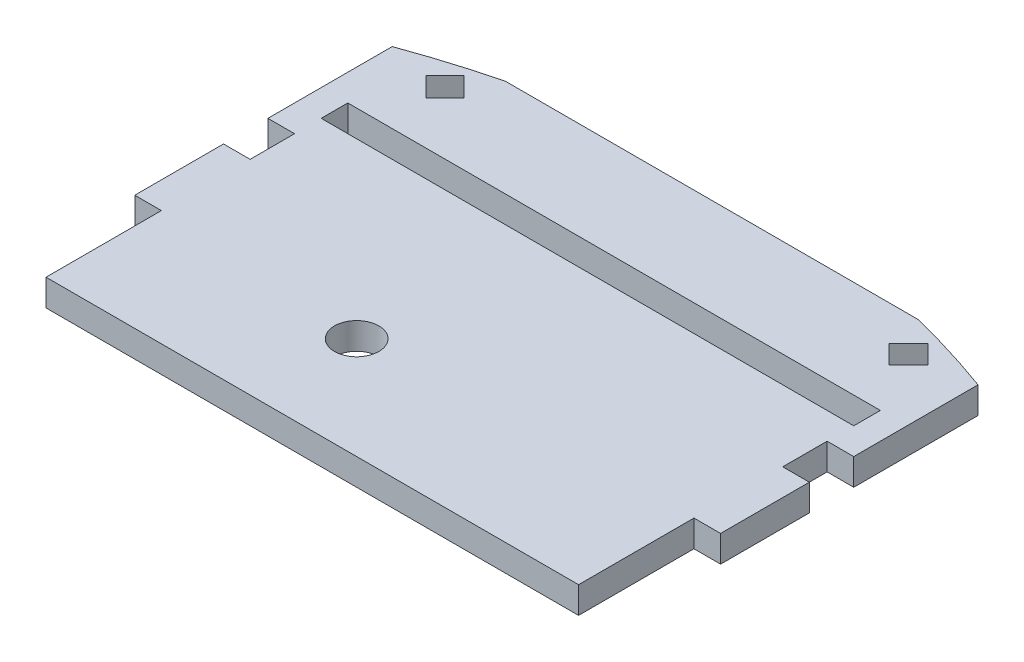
ISO-10303-21;
HEADER;
FILE_DESCRIPTION(('STEP AP214'),'2;1');
FILE_NAME('part.step','',(''),(''),'','','');
FILE_SCHEMA(('AUTOMOTIVE_DESIGN { 1 0 10303 214 1 1 1 1 }'));
ENDSEC;
DATA;
#1=APPLICATION_CONTEXT('core data for automotive mechanical design processes');
#2=APPLICATION_PROTOCOL_DEFINITION('international standard','automotive_design',2000,#1);
#3=PRODUCT_CONTEXT('',#1,'mechanical');
#4=PRODUCT('Part','Part','',(#3));
#5=PRODUCT_RELATED_PRODUCT_CATEGORY('part','',(#4));
#6=PRODUCT_DEFINITION_FORMATION('','',#4);
#7=PRODUCT_DEFINITION_CONTEXT('part definition',#1,'design');
#8=PRODUCT_DEFINITION('design','',#6,#7);
#9=PRODUCT_DEFINITION_SHAPE('','',#8);
#10=(LENGTH_UNIT() NAMED_UNIT(*) SI_UNIT(.MILLI.,.METRE.));
#11=(NAMED_UNIT(*) PLANE_ANGLE_UNIT() SI_UNIT($,.RADIAN.));
#12=(NAMED_UNIT(*) SI_UNIT($,.STERADIAN.) SOLID_ANGLE_UNIT());
#13=UNCERTAINTY_MEASURE_WITH_UNIT(LENGTH_MEASURE(1.E-05),#10,'distance_accuracy_value','');
#14=(GEOMETRIC_REPRESENTATION_CONTEXT(3) GLOBAL_UNCERTAINTY_ASSIGNED_CONTEXT((#13)) GLOBAL_UNIT_ASSIGNED_CONTEXT((#10,
#11,#12)) REPRESENTATION_CONTEXT('',''));
#15=CARTESIAN_POINT('',(0.,0.,0.));
#16=DIRECTION('',(0.,0.,1.));
#17=DIRECTION('',(1.,0.,0.));
#18=AXIS2_PLACEMENT_3D('',#15,#16,#17);
#19=CARTESIAN_POINT('',(30.,3.,18.));
#20=DIRECTION('',(0.,1.,0.));
#21=DIRECTION('',(0.,0.,1.));
#22=AXIS2_PLACEMENT_3D('',#19,#20,#21);
#23=PLANE('',#22);
#24=DIRECTION('',(0.707106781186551,0.,-0.707106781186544));
#25=VECTOR('',#24,1.);
#26=CARTESIAN_POINT('',(-26.0811183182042,3.,-20.9188816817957));
#27=LINE('',#26,#25);
#28=CARTESIAN_POINT('',(-26.0811183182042,3.,-20.9188816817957));
#29=VERTEX_POINT('',#28);
#30=CARTESIAN_POINT('',(-23.9597979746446,3.,-23.0402020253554));
#31=VERTEX_POINT('',#30);
#32=EDGE_CURVE('E479',#29,#31,#27,.T.);
#33=ORIENTED_EDGE('',*,*,#32,.F.);
#34=DIRECTION('',(0.707106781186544,0.,0.707106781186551));
#35=VECTOR('',#34,1.);
#36=CARTESIAN_POINT('',(-26.0811183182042,3.,-20.9188816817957));
#37=LINE('',#36,#35);
#38=CARTESIAN_POINT('',(-28.2731493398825,3.,-23.110912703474));
#39=VERTEX_POINT('',#38);
#40=EDGE_CURVE('E464',#39,#29,#37,.T.);
#41=ORIENTED_EDGE('',*,*,#40,.F.);
#42=DIRECTION('',(-0.707106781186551,0.,0.707106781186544));
#43=VECTOR('',#42,1.);
#44=CARTESIAN_POINT('',(-28.2731493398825,3.,-23.110912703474));
#45=LINE('',#44,#43);
#46=CARTESIAN_POINT('',(-26.1518289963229,3.,-25.2322330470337));
#47=VERTEX_POINT('',#46);
#48=EDGE_CURVE('E460',#47,#39,#45,.T.);
#49=ORIENTED_EDGE('',*,*,#48,.F.);
#50=DIRECTION('',(-0.707106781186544,0.,-0.707106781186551));
#51=VECTOR('',#50,1.);
#52=CARTESIAN_POINT('',(-23.9597979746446,3.,-23.0402020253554));
#53=LINE('',#52,#51);
#54=EDGE_CURVE('E476',#31,#47,#53,.T.);
#55=ORIENTED_EDGE('',*,*,#54,.F.);
#56=EDGE_LOOP('',(#33,#41,#49,#55));
#57=FACE_BOUND('',#56,.T.);
#58=CARTESIAN_POINT('',(-6.5,3.,6.5));
#59=DIRECTION('',(0.,1.,0.));
#60=DIRECTION('',(0.,0.,1.));
#61=AXIS2_PLACEMENT_3D('',#58,#59,#60);
#62=CIRCLE('',#61,2.5);
#63=CARTESIAN_POINT('',(-6.5,3.,9.));
#64=VERTEX_POINT('',#63);
#65=EDGE_CURVE('E367',#64,#64,#62,.T.);
#66=ORIENTED_EDGE('',*,*,#65,.F.);
#67=EDGE_LOOP('',(#66));
#68=FACE_BOUND('',#67,.T.);
#69=DIRECTION('',(-1.,0.,0.));
#70=VECTOR('',#69,1.);
#71=CARTESIAN_POINT('',(-30.,3.,-16.));
#72=LINE('',#71,#70);
#73=CARTESIAN_POINT('',(30.,3.,-16.));
#74=VERTEX_POINT('',#73);
#75=CARTESIAN_POINT('',(-30.,3.,-16.));
#76=VERTEX_POINT('',#75);
#77=EDGE_CURVE('E448',#74,#76,#72,.T.);
#78=ORIENTED_EDGE('',*,*,#77,.F.);
#79=DIRECTION('',(0.,0.,-1.));
#80=VECTOR('',#79,1.);
#81=CARTESIAN_POINT('',(30.,3.,-16.));
#82=LINE('',#81,#80);
#83=CARTESIAN_POINT('',(30.,3.,-13.));
#84=VERTEX_POINT('',#83);
#85=EDGE_CURVE('E433',#84,#74,#82,.T.);
#86=ORIENTED_EDGE('',*,*,#85,.F.);
#87=DIRECTION('',(1.,0.,0.));
#88=VECTOR('',#87,1.);
#89=CARTESIAN_POINT('',(-30.,3.,-13.));
#90=LINE('',#89,#88);
#91=CARTESIAN_POINT('',(-30.,3.,-13.));
#92=VERTEX_POINT('',#91);
#93=EDGE_CURVE('E429',#92,#84,#90,.T.);
#94=ORIENTED_EDGE('',*,*,#93,.F.);
#95=DIRECTION('',(0.,0.,1.));
#96=VECTOR('',#95,1.);
#97=CARTESIAN_POINT('',(-30.,3.,-16.));
#98=LINE('',#97,#96);
#99=EDGE_CURVE('E445',#76,#92,#98,.T.);
#100=ORIENTED_EDGE('',*,*,#99,.F.);
#101=EDGE_LOOP('',(#78,#86,#94,#100));
#102=FACE_BOUND('',#101,.T.);
#103=DIRECTION('',(-0.707106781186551,0.,-0.707106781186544));
#104=VECTOR('',#103,1.);
#105=CARTESIAN_POINT('',(28.2731493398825,3.,-23.110912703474));
#106=LINE('',#105,#104);
#107=CARTESIAN_POINT('',(28.2731493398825,3.,-23.110912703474));
#108=VERTEX_POINT('',#107);
#109=CARTESIAN_POINT('',(26.1518289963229,3.,-25.2322330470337));
#110=VERTEX_POINT('',#109);
#111=EDGE_CURVE('E510',#108,#110,#106,.T.);
#112=ORIENTED_EDGE('',*,*,#111,.F.);
#113=DIRECTION('',(0.707106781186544,0.,-0.707106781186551));
#114=VECTOR('',#113,1.);
#115=CARTESIAN_POINT('',(26.0811183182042,3.,-20.9188816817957));
#116=LINE('',#115,#114);
#117=CARTESIAN_POINT('',(26.0811183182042,3.,-20.9188816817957));
#118=VERTEX_POINT('',#117);
#119=EDGE_CURVE('E495',#118,#108,#116,.T.);
#120=ORIENTED_EDGE('',*,*,#119,.F.);
#121=DIRECTION('',(0.707106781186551,0.,0.707106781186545));
#122=VECTOR('',#121,1.);
#123=CARTESIAN_POINT('',(26.0811183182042,3.,-20.9188816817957));
#124=LINE('',#123,#122);
#125=CARTESIAN_POINT('',(23.9597979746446,3.,-23.0402020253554));
#126=VERTEX_POINT('',#125);
#127=EDGE_CURVE('E491',#126,#118,#124,.T.);
#128=ORIENTED_EDGE('',*,*,#127,.F.);
#129=DIRECTION('',(-0.707106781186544,0.,0.707106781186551));
#130=VECTOR('',#129,1.);
#131=CARTESIAN_POINT('',(23.9597979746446,3.,-23.0402020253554));
#132=LINE('',#131,#130);
#133=EDGE_CURVE('E507',#110,#126,#132,.T.);
#134=ORIENTED_EDGE('',*,*,#133,.F.);
#135=EDGE_LOOP('',(#112,#120,#128,#134));
#136=FACE_BOUND('',#135,.T.);
#137=DIRECTION('',(0.,0.,-1.));
#138=VECTOR('',#137,1.);
#139=CARTESIAN_POINT('',(33.,3.,-27.));
#140=LINE('',#139,#138);
#141=CARTESIAN_POINT('',(33.,3.,-10.));
#142=VERTEX_POINT('',#141);
#143=CARTESIAN_POINT('',(33.,3.,-24.));
#144=VERTEX_POINT('',#143);
#145=EDGE_CURVE('E261',#142,#144,#140,.T.);
#146=ORIENTED_EDGE('',*,*,#145,.T.);
#147=CARTESIAN_POINT('',(0.,3.,66.));
#148=DIRECTION('',(0.,1.,0.));
#149=DIRECTION('',(0.,0.,1.));
#150=AXIS2_PLACEMENT_3D('',#147,#148,#149);
#151=CIRCLE('',#150,95.8592718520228);
#152=CARTESIAN_POINT('',(23.2379000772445,3.,-27.));
#153=VERTEX_POINT('',#152);
#154=EDGE_CURVE('E251',#153,#144,#151,.F.);
#155=ORIENTED_EDGE('',*,*,#154,.F.);
#156=DIRECTION('',(-1.,0.,0.));
#157=VECTOR('',#156,1.);
#158=CARTESIAN_POINT('',(-33.,3.,-27.));
#159=LINE('',#158,#157);
#160=CARTESIAN_POINT('',(-23.2379000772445,3.,-27.));
#161=VERTEX_POINT('',#160);
#162=EDGE_CURVE('E250',#153,#161,#159,.T.);
#163=ORIENTED_EDGE('',*,*,#162,.T.);
#164=CARTESIAN_POINT('',(-33.,3.,-24.));
#165=VERTEX_POINT('',#164);
#166=EDGE_CURVE('E234',#165,#161,#151,.F.);
#167=ORIENTED_EDGE('',*,*,#166,.F.);
#168=DIRECTION('',(0.,0.,1.));
#169=VECTOR('',#168,1.);
#170=CARTESIAN_POINT('',(-33.,3.,-27.));
#171=LINE('',#170,#169);
#172=CARTESIAN_POINT('',(-33.,3.,-10.));
#173=VERTEX_POINT('',#172);
#174=EDGE_CURVE('E246',#165,#173,#171,.T.);
#175=ORIENTED_EDGE('',*,*,#174,.T.);
#176=DIRECTION('',(1.,0.,0.));
#177=VECTOR('',#176,1.);
#178=CARTESIAN_POINT('',(-33.,3.,-10.));
#179=LINE('',#178,#177);
#180=CARTESIAN_POINT('',(-30.,3.,-10.));
#181=VERTEX_POINT('',#180);
#182=EDGE_CURVE('E259',#173,#181,#179,.T.);
#183=ORIENTED_EDGE('',*,*,#182,.T.);
#184=DIRECTION('',(0.,0.,1.));
#185=VECTOR('',#184,1.);
#186=CARTESIAN_POINT('',(-30.,3.,-18.));
#187=LINE('',#186,#185);
#188=CARTESIAN_POINT('',(-30.,3.,-4.99999999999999));
#189=VERTEX_POINT('',#188);
#190=EDGE_CURVE('E39',#181,#189,#187,.T.);
#191=ORIENTED_EDGE('',*,*,#190,.T.);
#192=DIRECTION('',(-1.,0.,0.));
#193=VECTOR('',#192,1.);
#194=CARTESIAN_POINT('',(-33.,3.,-4.99999999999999));
#195=LINE('',#194,#193);
#196=CARTESIAN_POINT('',(-33.,3.,-4.99999999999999));
#197=VERTEX_POINT('',#196);
#198=EDGE_CURVE('E346',#189,#197,#195,.T.);
#199=ORIENTED_EDGE('',*,*,#198,.T.);
#200=DIRECTION('',(0.,0.,1.));
#201=VECTOR('',#200,1.);
#202=CARTESIAN_POINT('',(-33.,3.,-4.99999999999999));
#203=LINE('',#202,#201);
#204=CARTESIAN_POINT('',(-33.,3.,5.00000000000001));
#205=VERTEX_POINT('',#204);
#206=EDGE_CURVE('E358',#197,#205,#203,.T.);
#207=ORIENTED_EDGE('',*,*,#206,.T.);
#208=DIRECTION('',(1.,0.,0.));
#209=VECTOR('',#208,1.);
#210=CARTESIAN_POINT('',(-33.,3.,5.00000000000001));
#211=LINE('',#210,#209);
#212=CARTESIAN_POINT('',(-30.,3.,5.00000000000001));
#213=VERTEX_POINT('',#212);
#214=EDGE_CURVE('E880',#205,#213,#211,.T.);
#215=ORIENTED_EDGE('',*,*,#214,.T.);
#216=CARTESIAN_POINT('',(-30.,3.,18.));
#217=VERTEX_POINT('',#216);
#218=EDGE_CURVE('E327',#213,#217,#187,.T.);
#219=ORIENTED_EDGE('',*,*,#218,.T.);
#220=DIRECTION('',(1.,0.,0.));
#221=VECTOR('',#220,1.);
#222=CARTESIAN_POINT('',(-30.,3.,18.));
#223=LINE('',#222,#221);
#224=CARTESIAN_POINT('',(30.,3.,18.));
#225=VERTEX_POINT('',#224);
#226=EDGE_CURVE('E337',#217,#225,#223,.T.);
#227=ORIENTED_EDGE('',*,*,#226,.T.);
#228=DIRECTION('',(0.,0.,-1.));
#229=VECTOR('',#228,1.);
#230=CARTESIAN_POINT('',(30.,3.,-18.));
#231=LINE('',#230,#229);
#232=CARTESIAN_POINT('',(30.,3.,5.00000000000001));
#233=VERTEX_POINT('',#232);
#234=EDGE_CURVE('E329',#225,#233,#231,.T.);
#235=ORIENTED_EDGE('',*,*,#234,.T.);
#236=DIRECTION('',(1.,0.,0.));
#237=VECTOR('',#236,1.);
#238=CARTESIAN_POINT('',(33.,3.,5.00000000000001));
#239=LINE('',#238,#237);
#240=CARTESIAN_POINT('',(33.,3.,5.00000000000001));
#241=VERTEX_POINT('',#240);
#242=EDGE_CURVE('E296',#233,#241,#239,.T.);
#243=ORIENTED_EDGE('',*,*,#242,.T.);
#244=DIRECTION('',(0.,0.,-1.));
#245=VECTOR('',#244,1.);
#246=CARTESIAN_POINT('',(33.,3.,-4.99999999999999));
#247=LINE('',#246,#245);
#248=CARTESIAN_POINT('',(33.,3.,-4.99999999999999));
#249=VERTEX_POINT('',#248);
#250=EDGE_CURVE('E284',#241,#249,#247,.T.);
#251=ORIENTED_EDGE('',*,*,#250,.T.);
#252=DIRECTION('',(-1.,0.,0.));
#253=VECTOR('',#252,1.);
#254=CARTESIAN_POINT('',(33.,3.,-4.99999999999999));
#255=LINE('',#254,#253);
#256=CARTESIAN_POINT('',(30.,3.,-4.99999999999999));
#257=VERTEX_POINT('',#256);
#258=EDGE_CURVE('E287',#249,#257,#255,.T.);
#259=ORIENTED_EDGE('',*,*,#258,.T.);
#260=CARTESIAN_POINT('',(30.,3.,-10.));
#261=VERTEX_POINT('',#260);
#262=EDGE_CURVE('E393',#257,#261,#231,.T.);
#263=ORIENTED_EDGE('',*,*,#262,.T.);
#264=EDGE_CURVE('E257',#261,#142,#179,.T.);
#265=ORIENTED_EDGE('',*,*,#264,.T.);
#266=EDGE_LOOP('',(#146,#155,#163,#167,#175,#183,#191,#199,#207,#215,#219,#227,#235,#243,#251,
#259,#263,#265));
#267=FACE_BOUND('',#266,.T.);
#268=ADVANCED_FACE('F35',(#57,#68,#102,#136,#267),#23,.T.);
#269=CARTESIAN_POINT('',(30.,0.,18.));
#270=DIRECTION('',(0.,1.,0.));
#271=DIRECTION('',(0.,0.,1.));
#272=AXIS2_PLACEMENT_3D('',#269,#270,#271);
#273=PLANE('',#272);
#274=DIRECTION('',(0.707106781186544,0.,0.707106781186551));
#275=VECTOR('',#274,1.);
#276=CARTESIAN_POINT('',(-26.0811183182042,0.,-20.9188816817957));
#277=LINE('',#276,#275);
#278=CARTESIAN_POINT('',(-28.2731493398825,0.,-23.110912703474));
#279=VERTEX_POINT('',#278);
#280=CARTESIAN_POINT('',(-26.0811183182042,0.,-20.9188816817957));
#281=VERTEX_POINT('',#280);
#282=EDGE_CURVE('E471',#279,#281,#277,.T.);
#283=ORIENTED_EDGE('',*,*,#282,.T.);
#284=DIRECTION('',(0.707106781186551,0.,-0.707106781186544));
#285=VECTOR('',#284,1.);
#286=CARTESIAN_POINT('',(-26.0811183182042,0.,-20.9188816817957));
#287=LINE('',#286,#285);
#288=CARTESIAN_POINT('',(-23.9597979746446,0.,-23.0402020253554));
#289=VERTEX_POINT('',#288);
#290=EDGE_CURVE('E468',#281,#289,#287,.T.);
#291=ORIENTED_EDGE('',*,*,#290,.T.);
#292=DIRECTION('',(-0.707106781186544,0.,-0.707106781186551));
#293=VECTOR('',#292,1.);
#294=CARTESIAN_POINT('',(-23.9597979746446,0.,-23.0402020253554));
#295=LINE('',#294,#293);
#296=CARTESIAN_POINT('',(-26.1518289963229,0.,-25.2322330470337));
#297=VERTEX_POINT('',#296);
#298=EDGE_CURVE('E465',#289,#297,#295,.T.);
#299=ORIENTED_EDGE('',*,*,#298,.T.);
#300=DIRECTION('',(-0.707106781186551,0.,0.707106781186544));
#301=VECTOR('',#300,1.);
#302=CARTESIAN_POINT('',(-28.2731493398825,0.,-23.110912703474));
#303=LINE('',#302,#301);
#304=EDGE_CURVE('E461',#297,#279,#303,.T.);
#305=ORIENTED_EDGE('',*,*,#304,.T.);
#306=EDGE_LOOP('',(#283,#291,#299,#305));
#307=FACE_BOUND('',#306,.T.);
#308=CARTESIAN_POINT('',(-6.5,0.,6.5));
#309=DIRECTION('',(0.,1.,0.));
#310=DIRECTION('',(0.,0.,1.));
#311=AXIS2_PLACEMENT_3D('',#308,#309,#310);
#312=CIRCLE('',#311,2.5);
#313=CARTESIAN_POINT('',(-6.5,0.,9.));
#314=VERTEX_POINT('',#313);
#315=EDGE_CURVE('E364',#314,#314,#312,.T.);
#316=ORIENTED_EDGE('',*,*,#315,.T.);
#317=EDGE_LOOP('',(#316));
#318=FACE_BOUND('',#317,.T.);
#319=DIRECTION('',(0.,0.,-1.));
#320=VECTOR('',#319,1.);
#321=CARTESIAN_POINT('',(30.,0.,-16.));
#322=LINE('',#321,#320);
#323=CARTESIAN_POINT('',(30.,0.,-13.));
#324=VERTEX_POINT('',#323);
#325=CARTESIAN_POINT('',(30.,0.,-16.));
#326=VERTEX_POINT('',#325);
#327=EDGE_CURVE('E440',#324,#326,#322,.T.);
#328=ORIENTED_EDGE('',*,*,#327,.T.);
#329=DIRECTION('',(-1.,0.,0.));
#330=VECTOR('',#329,1.);
#331=CARTESIAN_POINT('',(-30.,0.,-16.));
#332=LINE('',#331,#330);
#333=CARTESIAN_POINT('',(-30.,0.,-16.));
#334=VERTEX_POINT('',#333);
#335=EDGE_CURVE('E437',#326,#334,#332,.T.);
#336=ORIENTED_EDGE('',*,*,#335,.T.);
#337=DIRECTION('',(0.,0.,1.));
#338=VECTOR('',#337,1.);
#339=CARTESIAN_POINT('',(-30.,0.,-16.));
#340=LINE('',#339,#338);
#341=CARTESIAN_POINT('',(-30.,0.,-13.));
#342=VERTEX_POINT('',#341);
#343=EDGE_CURVE('E434',#334,#342,#340,.T.);
#344=ORIENTED_EDGE('',*,*,#343,.T.);
#345=DIRECTION('',(1.,0.,0.));
#346=VECTOR('',#345,1.);
#347=CARTESIAN_POINT('',(-30.,0.,-13.));
#348=LINE('',#347,#346);
#349=EDGE_CURVE('E430',#342,#324,#348,.T.);
#350=ORIENTED_EDGE('',*,*,#349,.T.);
#351=EDGE_LOOP('',(#328,#336,#344,#350));
#352=FACE_BOUND('',#351,.T.);
#353=DIRECTION('',(0.707106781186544,0.,-0.707106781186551));
#354=VECTOR('',#353,1.);
#355=CARTESIAN_POINT('',(26.0811183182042,0.,-20.9188816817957));
#356=LINE('',#355,#354);
#357=CARTESIAN_POINT('',(26.0811183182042,0.,-20.9188816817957));
#358=VERTEX_POINT('',#357);
#359=CARTESIAN_POINT('',(28.2731493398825,0.,-23.110912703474));
#360=VERTEX_POINT('',#359);
#361=EDGE_CURVE('E502',#358,#360,#356,.T.);
#362=ORIENTED_EDGE('',*,*,#361,.T.);
#363=DIRECTION('',(-0.707106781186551,0.,-0.707106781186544));
#364=VECTOR('',#363,1.);
#365=CARTESIAN_POINT('',(28.2731493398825,0.,-23.110912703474));
#366=LINE('',#365,#364);
#367=CARTESIAN_POINT('',(26.1518289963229,0.,-25.2322330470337));
#368=VERTEX_POINT('',#367);
#369=EDGE_CURVE('E499',#360,#368,#366,.T.);
#370=ORIENTED_EDGE('',*,*,#369,.T.);
#371=DIRECTION('',(-0.707106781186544,0.,0.707106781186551));
#372=VECTOR('',#371,1.);
#373=CARTESIAN_POINT('',(23.9597979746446,0.,-23.0402020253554));
#374=LINE('',#373,#372);
#375=CARTESIAN_POINT('',(23.9597979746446,0.,-23.0402020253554));
#376=VERTEX_POINT('',#375);
#377=EDGE_CURVE('E496',#368,#376,#374,.T.);
#378=ORIENTED_EDGE('',*,*,#377,.T.);
#379=DIRECTION('',(0.707106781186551,0.,0.707106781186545));
#380=VECTOR('',#379,1.);
#381=CARTESIAN_POINT('',(26.0811183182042,0.,-20.9188816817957));
#382=LINE('',#381,#380);
#383=EDGE_CURVE('E492',#376,#358,#382,.T.);
#384=ORIENTED_EDGE('',*,*,#383,.T.);
#385=EDGE_LOOP('',(#362,#370,#378,#384));
#386=FACE_BOUND('',#385,.T.);
#387=CARTESIAN_POINT('',(0.,0.,66.));
#388=DIRECTION('',(0.,1.,0.));
#389=DIRECTION('',(0.,0.,1.));
#390=AXIS2_PLACEMENT_3D('',#387,#388,#389);
#391=CIRCLE('',#390,95.8592718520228);
#392=CARTESIAN_POINT('',(23.2379000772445,0.,-27.));
#393=VERTEX_POINT('',#392);
#394=CARTESIAN_POINT('',(33.,0.,-24.));
#395=VERTEX_POINT('',#394);
#396=EDGE_CURVE('E53',#393,#395,#391,.F.);
#397=ORIENTED_EDGE('',*,*,#396,.T.);
#398=DIRECTION('',(0.,0.,-1.));
#399=VECTOR('',#398,1.);
#400=CARTESIAN_POINT('',(33.,0.,-27.));
#401=LINE('',#400,#399);
#402=CARTESIAN_POINT('',(33.,0.,-10.));
#403=VERTEX_POINT('',#402);
#404=EDGE_CURVE('E266',#403,#395,#401,.T.);
#405=ORIENTED_EDGE('',*,*,#404,.F.);
#406=DIRECTION('',(1.,0.,0.));
#407=VECTOR('',#406,1.);
#408=CARTESIAN_POINT('',(-33.,0.,-10.));
#409=LINE('',#408,#407);
#410=CARTESIAN_POINT('',(30.,0.,-10.));
#411=VERTEX_POINT('',#410);
#412=EDGE_CURVE('E275',#411,#403,#409,.T.);
#413=ORIENTED_EDGE('',*,*,#412,.F.);
#414=DIRECTION('',(0.,0.,-1.));
#415=VECTOR('',#414,1.);
#416=CARTESIAN_POINT('',(30.,0.,-18.));
#417=LINE('',#416,#415);
#418=CARTESIAN_POINT('',(30.,0.,-4.99999999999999));
#419=VERTEX_POINT('',#418);
#420=EDGE_CURVE('E380',#419,#411,#417,.T.);
#421=ORIENTED_EDGE('',*,*,#420,.F.);
#422=DIRECTION('',(-1.,0.,0.));
#423=VECTOR('',#422,1.);
#424=CARTESIAN_POINT('',(33.,0.,-4.99999999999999));
#425=LINE('',#424,#423);
#426=CARTESIAN_POINT('',(33.,0.,-4.99999999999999));
#427=VERTEX_POINT('',#426);
#428=EDGE_CURVE('E291',#427,#419,#425,.T.);
#429=ORIENTED_EDGE('',*,*,#428,.F.);
#430=DIRECTION('',(0.,0.,-1.));
#431=VECTOR('',#430,1.);
#432=CARTESIAN_POINT('',(33.,0.,-4.99999999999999));
#433=LINE('',#432,#431);
#434=CARTESIAN_POINT('',(33.,0.,5.00000000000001));
#435=VERTEX_POINT('',#434);
#436=EDGE_CURVE('E283',#435,#427,#433,.T.);
#437=ORIENTED_EDGE('',*,*,#436,.F.);
#438=DIRECTION('',(1.,0.,0.));
#439=VECTOR('',#438,1.);
#440=CARTESIAN_POINT('',(33.,0.,5.00000000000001));
#441=LINE('',#440,#439);
#442=CARTESIAN_POINT('',(30.,0.,5.00000000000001));
#443=VERTEX_POINT('',#442);
#444=EDGE_CURVE('E288',#443,#435,#441,.T.);
#445=ORIENTED_EDGE('',*,*,#444,.F.);
#446=CARTESIAN_POINT('',(30.,0.,18.));
#447=VERTEX_POINT('',#446);
#448=EDGE_CURVE('E326',#447,#443,#417,.T.);
#449=ORIENTED_EDGE('',*,*,#448,.F.);
#450=DIRECTION('',(1.,0.,0.));
#451=VECTOR('',#450,1.);
#452=CARTESIAN_POINT('',(-30.,0.,18.));
#453=LINE('',#452,#451);
#454=CARTESIAN_POINT('',(-30.,0.,18.));
#455=VERTEX_POINT('',#454);
#456=EDGE_CURVE('E314',#455,#447,#453,.T.);
#457=ORIENTED_EDGE('',*,*,#456,.F.);
#458=DIRECTION('',(0.,0.,1.));
#459=VECTOR('',#458,1.);
#460=CARTESIAN_POINT('',(-30.,0.,-18.));
#461=LINE('',#460,#459);
#462=CARTESIAN_POINT('',(-30.,0.,5.00000000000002));
#463=VERTEX_POINT('',#462);
#464=EDGE_CURVE('E315',#463,#455,#461,.T.);
#465=ORIENTED_EDGE('',*,*,#464,.F.);
#466=DIRECTION('',(1.,0.,0.));
#467=VECTOR('',#466,1.);
#468=CARTESIAN_POINT('',(-33.,0.,5.00000000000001));
#469=LINE('',#468,#467);
#470=CARTESIAN_POINT('',(-33.,0.,5.00000000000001));
#471=VERTEX_POINT('',#470);
#472=EDGE_CURVE('E359',#471,#463,#469,.T.);
#473=ORIENTED_EDGE('',*,*,#472,.F.);
#474=DIRECTION('',(0.,0.,1.));
#475=VECTOR('',#474,1.);
#476=CARTESIAN_POINT('',(-33.,0.,-4.99999999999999));
#477=LINE('',#476,#475);
#478=CARTESIAN_POINT('',(-33.,0.,-4.99999999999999));
#479=VERTEX_POINT('',#478);
#480=EDGE_CURVE('E877',#479,#471,#477,.T.);
#481=ORIENTED_EDGE('',*,*,#480,.F.);
#482=DIRECTION('',(-1.,0.,0.));
#483=VECTOR('',#482,1.);
#484=CARTESIAN_POINT('',(-33.,0.,-4.99999999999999));
#485=LINE('',#484,#483);
#486=CARTESIAN_POINT('',(-30.,0.,-4.99999999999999));
#487=VERTEX_POINT('',#486);
#488=EDGE_CURVE('E374',#487,#479,#485,.T.);
#489=ORIENTED_EDGE('',*,*,#488,.F.);
#490=CARTESIAN_POINT('',(-30.,0.,-10.));
#491=VERTEX_POINT('',#490);
#492=EDGE_CURVE('E312',#491,#487,#461,.T.);
#493=ORIENTED_EDGE('',*,*,#492,.F.);
#494=CARTESIAN_POINT('',(-33.,0.,-10.));
#495=VERTEX_POINT('',#494);
#496=EDGE_CURVE('E276',#495,#491,#409,.T.);
#497=ORIENTED_EDGE('',*,*,#496,.F.);
#498=DIRECTION('',(0.,0.,1.));
#499=VECTOR('',#498,1.);
#500=CARTESIAN_POINT('',(-33.,0.,-27.));
#501=LINE('',#500,#499);
#502=CARTESIAN_POINT('',(-33.,0.,-24.));
#503=VERTEX_POINT('',#502);
#504=EDGE_CURVE('E273',#503,#495,#501,.T.);
#505=ORIENTED_EDGE('',*,*,#504,.F.);
#506=CARTESIAN_POINT('',(-23.2379000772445,0.,-27.));
#507=VERTEX_POINT('',#506);
#508=EDGE_CURVE('E61',#503,#507,#391,.F.);
#509=ORIENTED_EDGE('',*,*,#508,.T.);
#510=DIRECTION('',(-1.,0.,0.));
#511=VECTOR('',#510,1.);
#512=CARTESIAN_POINT('',(-33.,0.,-27.));
#513=LINE('',#512,#511);
#514=EDGE_CURVE('E269',#393,#507,#513,.T.);
#515=ORIENTED_EDGE('',*,*,#514,.F.);
#516=EDGE_LOOP('',(#397,#405,#413,#421,#429,#437,#445,#449,#457,#465,#473,#481,#489,#493,#497,
#505,#509,#515));
#517=FACE_BOUND('',#516,.T.);
#518=ADVANCED_FACE('F413',(#307,#318,#352,#386,#517),#273,.F.);
#519=CARTESIAN_POINT('',(33.,3.,-27.));
#520=DIRECTION('',(-1.,0.,0.));
#521=DIRECTION('',(0.,0.,1.));
#522=AXIS2_PLACEMENT_3D('',#519,#520,#521);
#523=PLANE('',#522);
#524=DIRECTION('',(0.,-1.,0.));
#525=VECTOR('',#524,1.);
#526=CARTESIAN_POINT('',(33.,3.,-24.));
#527=LINE('',#526,#525);
#528=EDGE_CURVE('E240',#144,#395,#527,.T.);
#529=ORIENTED_EDGE('',*,*,#528,.F.);
#530=ORIENTED_EDGE('',*,*,#145,.F.);
#531=DIRECTION('',(0.,-1.,0.));
#532=VECTOR('',#531,1.);
#533=CARTESIAN_POINT('',(33.,3.,-10.));
#534=LINE('',#533,#532);
#535=EDGE_CURVE('E265',#142,#403,#534,.T.);
#536=ORIENTED_EDGE('',*,*,#535,.T.);
#537=ORIENTED_EDGE('',*,*,#404,.T.);
#538=EDGE_LOOP('',(#529,#530,#536,#537));
#539=FACE_BOUND('',#538,.T.);
#540=ADVANCED_FACE('F417',(#539),#523,.F.);
#541=CARTESIAN_POINT('',(-33.,3.,-27.));
#542=DIRECTION('',(0.,0.,1.));
#543=DIRECTION('',(1.,0.,0.));
#544=AXIS2_PLACEMENT_3D('',#541,#542,#543);
#545=PLANE('',#544);
#546=DIRECTION('',(0.,-1.,0.));
#547=VECTOR('',#546,1.);
#548=CARTESIAN_POINT('',(-23.2379000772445,3.,-27.));
#549=LINE('',#548,#547);
#550=EDGE_CURVE('E505',#161,#507,#549,.T.);
#551=ORIENTED_EDGE('',*,*,#550,.F.);
#552=ORIENTED_EDGE('',*,*,#162,.F.);
#553=DIRECTION('',(0.,-1.,0.));
#554=VECTOR('',#553,1.);
#555=CARTESIAN_POINT('',(23.2379000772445,3.,-27.));
#556=LINE('',#555,#554);
#557=EDGE_CURVE('E239',#393,#153,#556,.F.);
#558=ORIENTED_EDGE('',*,*,#557,.F.);
#559=ORIENTED_EDGE('',*,*,#514,.T.);
#560=EDGE_LOOP('',(#551,#552,#558,#559));
#561=FACE_BOUND('',#560,.T.);
#562=ADVANCED_FACE('F518',(#561),#545,.F.);
#563=CARTESIAN_POINT('',(-33.,3.,-27.));
#564=DIRECTION('',(1.,0.,0.));
#565=DIRECTION('',(0.,0.,-1.));
#566=AXIS2_PLACEMENT_3D('',#563,#564,#565);
#567=PLANE('',#566);
#568=DIRECTION('',(0.,-1.,0.));
#569=VECTOR('',#568,1.);
#570=CARTESIAN_POINT('',(-33.,3.,-24.));
#571=LINE('',#570,#569);
#572=EDGE_CURVE('E231',#165,#503,#571,.T.);
#573=ORIENTED_EDGE('',*,*,#572,.T.);
#574=ORIENTED_EDGE('',*,*,#504,.T.);
#575=DIRECTION('',(0.,-1.,0.));
#576=VECTOR('',#575,1.);
#577=CARTESIAN_POINT('',(-33.,3.,-10.));
#578=LINE('',#577,#576);
#579=EDGE_CURVE('E255',#173,#495,#578,.T.);
#580=ORIENTED_EDGE('',*,*,#579,.F.);
#581=ORIENTED_EDGE('',*,*,#174,.F.);
#582=EDGE_LOOP('',(#573,#574,#580,#581));
#583=FACE_BOUND('',#582,.T.);
#584=ADVANCED_FACE('F253',(#583),#567,.F.);
#585=CARTESIAN_POINT('',(-30.,3.,-18.));
#586=DIRECTION('',(1.,0.,0.));
#587=DIRECTION('',(0.,0.,-1.));
#588=AXIS2_PLACEMENT_3D('',#585,#586,#587);
#589=PLANE('',#588);
#590=DIRECTION('',(0.,1.,0.));
#591=VECTOR('',#590,1.);
#592=CARTESIAN_POINT('',(-30.,3.,-10.));
#593=LINE('',#592,#591);
#594=EDGE_CURVE('E281',#491,#181,#593,.T.);
#595=ORIENTED_EDGE('',*,*,#594,.F.);
#596=ORIENTED_EDGE('',*,*,#492,.T.);
#597=DIRECTION('',(0.,-1.,0.));
#598=VECTOR('',#597,1.);
#599=CARTESIAN_POINT('',(-30.,3.,-4.99999999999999));
#600=LINE('',#599,#598);
#601=EDGE_CURVE('E354',#189,#487,#600,.T.);
#602=ORIENTED_EDGE('',*,*,#601,.F.);
#603=ORIENTED_EDGE('',*,*,#190,.F.);
#604=EDGE_LOOP('',(#595,#596,#602,#603));
#605=FACE_BOUND('',#604,.T.);
#606=ADVANCED_FACE('F361',(#605),#589,.F.);
#607=CARTESIAN_POINT('',(30.,3.,-18.));
#608=DIRECTION('',(-1.,0.,0.));
#609=DIRECTION('',(0.,0.,1.));
#610=AXIS2_PLACEMENT_3D('',#607,#608,#609);
#611=PLANE('',#610);
#612=DIRECTION('',(0.,-1.,0.));
#613=VECTOR('',#612,1.);
#614=CARTESIAN_POINT('',(30.,3.,-10.));
#615=LINE('',#614,#613);
#616=EDGE_CURVE('E11',#261,#411,#615,.T.);
#617=ORIENTED_EDGE('',*,*,#616,.F.);
#618=ORIENTED_EDGE('',*,*,#262,.F.);
#619=DIRECTION('',(0.,-1.,0.));
#620=VECTOR('',#619,1.);
#621=CARTESIAN_POINT('',(30.,3.,-4.99999999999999));
#622=LINE('',#621,#620);
#623=EDGE_CURVE('E304',#257,#419,#622,.T.);
#624=ORIENTED_EDGE('',*,*,#623,.T.);
#625=ORIENTED_EDGE('',*,*,#420,.T.);
#626=EDGE_LOOP('',(#617,#618,#624,#625));
#627=FACE_BOUND('',#626,.T.);
#628=ADVANCED_FACE('F37',(#627),#611,.F.);
#629=DIRECTION('',(0.,-1.,0.));
#630=VECTOR('',#629,1.);
#631=CARTESIAN_POINT('',(30.,3.,5.00000000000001));
#632=LINE('',#631,#630);
#633=EDGE_CURVE('E295',#233,#443,#632,.T.);
#634=ORIENTED_EDGE('',*,*,#633,.F.);
#635=ORIENTED_EDGE('',*,*,#234,.F.);
#636=DIRECTION('',(0.,-1.,0.));
#637=VECTOR('',#636,1.);
#638=CARTESIAN_POINT('',(30.,3.,18.));
#639=LINE('',#638,#637);
#640=EDGE_CURVE('E339',#225,#447,#639,.T.);
#641=ORIENTED_EDGE('',*,*,#640,.T.);
#642=ORIENTED_EDGE('',*,*,#448,.T.);
#643=EDGE_LOOP('',(#634,#635,#641,#642));
#644=FACE_BOUND('',#643,.T.);
#645=ADVANCED_FACE('F546',(#644),#611,.F.);
#646=ORIENTED_EDGE('',*,*,#218,.F.);
#647=DIRECTION('',(0.,-1.,0.));
#648=VECTOR('',#647,1.);
#649=CARTESIAN_POINT('',(-30.,3.,5.00000000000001));
#650=LINE('',#649,#648);
#651=EDGE_CURVE('E330',#213,#463,#650,.T.);
#652=ORIENTED_EDGE('',*,*,#651,.T.);
#653=ORIENTED_EDGE('',*,*,#464,.T.);
#654=DIRECTION('',(0.,-1.,0.));
#655=VECTOR('',#654,1.);
#656=CARTESIAN_POINT('',(-30.,3.,18.));
#657=LINE('',#656,#655);
#658=EDGE_CURVE('E45',#217,#455,#657,.T.);
#659=ORIENTED_EDGE('',*,*,#658,.F.);
#660=EDGE_LOOP('',(#646,#652,#653,#659));
#661=FACE_BOUND('',#660,.T.);
#662=ADVANCED_FACE('F543',(#661),#589,.F.);
#663=CARTESIAN_POINT('',(-30.,3.,18.));
#664=DIRECTION('',(0.,0.,-1.));
#665=DIRECTION('',(-1.,0.,0.));
#666=AXIS2_PLACEMENT_3D('',#663,#664,#665);
#667=PLANE('',#666);
#668=ORIENTED_EDGE('',*,*,#456,.T.);
#669=ORIENTED_EDGE('',*,*,#640,.F.);
#670=ORIENTED_EDGE('',*,*,#226,.F.);
#671=ORIENTED_EDGE('',*,*,#658,.T.);
#672=EDGE_LOOP('',(#668,#669,#670,#671));
#673=FACE_BOUND('',#672,.T.);
#674=ADVANCED_FACE('F541',(#673),#667,.F.);
#675=CARTESIAN_POINT('',(-6.5,3.,6.5));
#676=DIRECTION('',(0.,-1.,0.));
#677=DIRECTION('',(0.,0.,-1.));
#678=AXIS2_PLACEMENT_3D('',#675,#676,#677);
#679=CYLINDRICAL_SURFACE('',#678,2.5);
#680=ORIENTED_EDGE('',*,*,#65,.T.);
#681=EDGE_LOOP('',(#680));
#682=FACE_BOUND('',#681,.T.);
#683=ORIENTED_EDGE('',*,*,#315,.F.);
#684=EDGE_LOOP('',(#683));
#685=FACE_BOUND('',#684,.T.);
#686=ADVANCED_FACE('F538',(#682,#685),#679,.F.);
#687=CARTESIAN_POINT('',(-33.,3.,-4.99999999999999));
#688=DIRECTION('',(0.,0.,1.));
#689=DIRECTION('',(1.,0.,0.));
#690=AXIS2_PLACEMENT_3D('',#687,#688,#689);
#691=PLANE('',#690);
#692=ORIENTED_EDGE('',*,*,#488,.T.);
#693=DIRECTION('',(0.,-1.,0.));
#694=VECTOR('',#693,1.);
#695=CARTESIAN_POINT('',(-33.,3.,-4.99999999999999));
#696=LINE('',#695,#694);
#697=EDGE_CURVE('E356',#197,#479,#696,.T.);
#698=ORIENTED_EDGE('',*,*,#697,.F.);
#699=ORIENTED_EDGE('',*,*,#198,.F.);
#700=ORIENTED_EDGE('',*,*,#601,.T.);
#701=EDGE_LOOP('',(#692,#698,#699,#700));
#702=FACE_BOUND('',#701,.T.);
#703=ADVANCED_FACE('F353',(#702),#691,.F.);
#704=CARTESIAN_POINT('',(-33.,3.,-4.99999999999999));
#705=DIRECTION('',(1.,0.,0.));
#706=DIRECTION('',(0.,0.,-1.));
#707=AXIS2_PLACEMENT_3D('',#704,#705,#706);
#708=PLANE('',#707);
#709=ORIENTED_EDGE('',*,*,#480,.T.);
#710=DIRECTION('',(0.,-1.,0.));
#711=VECTOR('',#710,1.);
#712=CARTESIAN_POINT('',(-33.,3.,5.00000000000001));
#713=LINE('',#712,#711);
#714=EDGE_CURVE('E368',#205,#471,#713,.T.);
#715=ORIENTED_EDGE('',*,*,#714,.F.);
#716=ORIENTED_EDGE('',*,*,#206,.F.);
#717=ORIENTED_EDGE('',*,*,#697,.T.);
#718=EDGE_LOOP('',(#709,#715,#716,#717));
#719=FACE_BOUND('',#718,.T.);
#720=ADVANCED_FACE('F583',(#719),#708,.F.);
#721=CARTESIAN_POINT('',(-33.,3.,5.00000000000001));
#722=DIRECTION('',(0.,0.,-1.));
#723=DIRECTION('',(-1.,0.,0.));
#724=AXIS2_PLACEMENT_3D('',#721,#722,#723);
#725=PLANE('',#724);
#726=ORIENTED_EDGE('',*,*,#472,.T.);
#727=ORIENTED_EDGE('',*,*,#651,.F.);
#728=ORIENTED_EDGE('',*,*,#214,.F.);
#729=ORIENTED_EDGE('',*,*,#714,.T.);
#730=EDGE_LOOP('',(#726,#727,#728,#729));
#731=FACE_BOUND('',#730,.T.);
#732=ADVANCED_FACE('F591',(#731),#725,.F.);
#733=CARTESIAN_POINT('',(33.,3.,-4.99999999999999));
#734=DIRECTION('',(-1.,0.,0.));
#735=DIRECTION('',(0.,0.,1.));
#736=AXIS2_PLACEMENT_3D('',#733,#734,#735);
#737=PLANE('',#736);
#738=ORIENTED_EDGE('',*,*,#436,.T.);
#739=DIRECTION('',(0.,-1.,0.));
#740=VECTOR('',#739,1.);
#741=CARTESIAN_POINT('',(33.,3.,-4.99999999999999));
#742=LINE('',#741,#740);
#743=EDGE_CURVE('E397',#249,#427,#742,.T.);
#744=ORIENTED_EDGE('',*,*,#743,.F.);
#745=ORIENTED_EDGE('',*,*,#250,.F.);
#746=DIRECTION('',(0.,-1.,0.));
#747=VECTOR('',#746,1.);
#748=CARTESIAN_POINT('',(33.,3.,5.00000000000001));
#749=LINE('',#748,#747);
#750=EDGE_CURVE('E292',#241,#435,#749,.T.);
#751=ORIENTED_EDGE('',*,*,#750,.T.);
#752=EDGE_LOOP('',(#738,#744,#745,#751));
#753=FACE_BOUND('',#752,.T.);
#754=ADVANCED_FACE('F601',(#753),#737,.F.);
#755=CARTESIAN_POINT('',(33.,3.,-4.99999999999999));
#756=DIRECTION('',(0.,0.,1.));
#757=DIRECTION('',(1.,0.,0.));
#758=AXIS2_PLACEMENT_3D('',#755,#756,#757);
#759=PLANE('',#758);
#760=ORIENTED_EDGE('',*,*,#428,.T.);
#761=ORIENTED_EDGE('',*,*,#623,.F.);
#762=ORIENTED_EDGE('',*,*,#258,.F.);
#763=ORIENTED_EDGE('',*,*,#743,.T.);
#764=EDGE_LOOP('',(#760,#761,#762,#763));
#765=FACE_BOUND('',#764,.T.);
#766=ADVANCED_FACE('F406',(#765),#759,.F.);
#767=CARTESIAN_POINT('',(33.,3.,5.00000000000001));
#768=DIRECTION('',(0.,0.,-1.));
#769=DIRECTION('',(-1.,0.,0.));
#770=AXIS2_PLACEMENT_3D('',#767,#768,#769);
#771=PLANE('',#770);
#772=ORIENTED_EDGE('',*,*,#444,.T.);
#773=ORIENTED_EDGE('',*,*,#750,.F.);
#774=ORIENTED_EDGE('',*,*,#242,.F.);
#775=ORIENTED_EDGE('',*,*,#633,.T.);
#776=EDGE_LOOP('',(#772,#773,#774,#775));
#777=FACE_BOUND('',#776,.T.);
#778=ADVANCED_FACE('F620',(#777),#771,.F.);
#779=CARTESIAN_POINT('',(-33.,3.,-10.));
#780=DIRECTION('',(0.,0.,-1.));
#781=DIRECTION('',(-1.,0.,0.));
#782=AXIS2_PLACEMENT_3D('',#779,#780,#781);
#783=PLANE('',#782);
#784=ORIENTED_EDGE('',*,*,#496,.T.);
#785=ORIENTED_EDGE('',*,*,#594,.T.);
#786=ORIENTED_EDGE('',*,*,#182,.F.);
#787=ORIENTED_EDGE('',*,*,#579,.T.);
#788=EDGE_LOOP('',(#784,#785,#786,#787));
#789=FACE_BOUND('',#788,.T.);
#790=ADVANCED_FACE('F628',(#789),#783,.F.);
#791=ORIENTED_EDGE('',*,*,#264,.F.);
#792=ORIENTED_EDGE('',*,*,#616,.T.);
#793=ORIENTED_EDGE('',*,*,#412,.T.);
#794=ORIENTED_EDGE('',*,*,#535,.F.);
#795=EDGE_LOOP('',(#791,#792,#793,#794));
#796=FACE_BOUND('',#795,.T.);
#797=ADVANCED_FACE('F409',(#796),#783,.F.);
#798=CARTESIAN_POINT('',(30.,3.,-16.));
#799=DIRECTION('',(-1.,0.,0.));
#800=DIRECTION('',(0.,0.,1.));
#801=AXIS2_PLACEMENT_3D('',#798,#799,#800);
#802=PLANE('',#801);
#803=ORIENTED_EDGE('',*,*,#327,.F.);
#804=DIRECTION('',(0.,-1.,0.));
#805=VECTOR('',#804,1.);
#806=CARTESIAN_POINT('',(30.,3.,-13.));
#807=LINE('',#806,#805);
#808=EDGE_CURVE('E426',#84,#324,#807,.T.);
#809=ORIENTED_EDGE('',*,*,#808,.F.);
#810=ORIENTED_EDGE('',*,*,#85,.T.);
#811=DIRECTION('',(0.,-1.,0.));
#812=VECTOR('',#811,1.);
#813=CARTESIAN_POINT('',(30.,3.,-16.));
#814=LINE('',#813,#812);
#815=EDGE_CURVE('E270',#74,#326,#814,.T.);
#816=ORIENTED_EDGE('',*,*,#815,.T.);
#817=EDGE_LOOP('',(#803,#809,#810,#816));
#818=FACE_BOUND('',#817,.T.);
#819=ADVANCED_FACE('F653',(#818),#802,.T.);
#820=CARTESIAN_POINT('',(-30.,3.,-16.));
#821=DIRECTION('',(0.,0.,1.));
#822=DIRECTION('',(1.,0.,0.));
#823=AXIS2_PLACEMENT_3D('',#820,#821,#822);
#824=PLANE('',#823);
#825=ORIENTED_EDGE('',*,*,#335,.F.);
#826=ORIENTED_EDGE('',*,*,#815,.F.);
#827=ORIENTED_EDGE('',*,*,#77,.T.);
#828=DIRECTION('',(0.,-1.,0.));
#829=VECTOR('',#828,1.);
#830=CARTESIAN_POINT('',(-30.,3.,-16.));
#831=LINE('',#830,#829);
#832=EDGE_CURVE('E422',#76,#334,#831,.T.);
#833=ORIENTED_EDGE('',*,*,#832,.T.);
#834=EDGE_LOOP('',(#825,#826,#827,#833));
#835=FACE_BOUND('',#834,.T.);
#836=ADVANCED_FACE('F660',(#835),#824,.T.);
#837=CARTESIAN_POINT('',(-30.,3.,-16.));
#838=DIRECTION('',(1.,0.,0.));
#839=DIRECTION('',(0.,0.,-1.));
#840=AXIS2_PLACEMENT_3D('',#837,#838,#839);
#841=PLANE('',#840);
#842=ORIENTED_EDGE('',*,*,#343,.F.);
#843=ORIENTED_EDGE('',*,*,#832,.F.);
#844=ORIENTED_EDGE('',*,*,#99,.T.);
#845=DIRECTION('',(0.,-1.,0.));
#846=VECTOR('',#845,1.);
#847=CARTESIAN_POINT('',(-30.,3.,-13.));
#848=LINE('',#847,#846);
#849=EDGE_CURVE('E424',#92,#342,#848,.T.);
#850=ORIENTED_EDGE('',*,*,#849,.T.);
#851=EDGE_LOOP('',(#842,#843,#844,#850));
#852=FACE_BOUND('',#851,.T.);
#853=ADVANCED_FACE('F669',(#852),#841,.T.);
#854=CARTESIAN_POINT('',(-30.,3.,-13.));
#855=DIRECTION('',(0.,0.,-1.));
#856=DIRECTION('',(-1.,0.,0.));
#857=AXIS2_PLACEMENT_3D('',#854,#855,#856);
#858=PLANE('',#857);
#859=ORIENTED_EDGE('',*,*,#349,.F.);
#860=ORIENTED_EDGE('',*,*,#849,.F.);
#861=ORIENTED_EDGE('',*,*,#93,.T.);
#862=ORIENTED_EDGE('',*,*,#808,.T.);
#863=EDGE_LOOP('',(#859,#860,#861,#862));
#864=FACE_BOUND('',#863,.T.);
#865=ADVANCED_FACE('F678',(#864),#858,.T.);
#866=CARTESIAN_POINT('',(-26.0811183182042,3.,-20.9188816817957));
#867=DIRECTION('',(0.707106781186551,0.,-0.707106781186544));
#868=DIRECTION('',(-0.707106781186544,0.,-0.707106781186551));
#869=AXIS2_PLACEMENT_3D('',#866,#867,#868);
#870=PLANE('',#869);
#871=ORIENTED_EDGE('',*,*,#282,.F.);
#872=DIRECTION('',(0.,-1.,0.));
#873=VECTOR('',#872,1.);
#874=CARTESIAN_POINT('',(-28.2731493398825,3.,-23.110912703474));
#875=LINE('',#874,#873);
#876=EDGE_CURVE('E457',#39,#279,#875,.T.);
#877=ORIENTED_EDGE('',*,*,#876,.F.);
#878=ORIENTED_EDGE('',*,*,#40,.T.);
#879=DIRECTION('',(0.,-1.,0.));
#880=VECTOR('',#879,1.);
#881=CARTESIAN_POINT('',(-26.0811183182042,3.,-20.9188816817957));
#882=LINE('',#881,#880);
#883=EDGE_CURVE('E443',#29,#281,#882,.T.);
#884=ORIENTED_EDGE('',*,*,#883,.T.);
#885=EDGE_LOOP('',(#871,#877,#878,#884));
#886=FACE_BOUND('',#885,.T.);
#887=ADVANCED_FACE('F687',(#886),#870,.T.);
#888=CARTESIAN_POINT('',(-26.0811183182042,3.,-20.9188816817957));
#889=DIRECTION('',(-0.707106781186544,0.,-0.707106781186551));
#890=DIRECTION('',(-0.707106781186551,0.,0.707106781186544));
#891=AXIS2_PLACEMENT_3D('',#888,#889,#890);
#892=PLANE('',#891);
#893=ORIENTED_EDGE('',*,*,#290,.F.);
#894=ORIENTED_EDGE('',*,*,#883,.F.);
#895=ORIENTED_EDGE('',*,*,#32,.T.);
#896=DIRECTION('',(0.,-1.,0.));
#897=VECTOR('',#896,1.);
#898=CARTESIAN_POINT('',(-23.9597979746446,3.,-23.0402020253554));
#899=LINE('',#898,#897);
#900=EDGE_CURVE('E453',#31,#289,#899,.T.);
#901=ORIENTED_EDGE('',*,*,#900,.T.);
#902=EDGE_LOOP('',(#893,#894,#895,#901));
#903=FACE_BOUND('',#902,.T.);
#904=ADVANCED_FACE('F696',(#903),#892,.T.);
#905=CARTESIAN_POINT('',(-23.9597979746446,3.,-23.0402020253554));
#906=DIRECTION('',(-0.707106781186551,0.,0.707106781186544));
#907=DIRECTION('',(0.707106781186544,0.,0.707106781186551));
#908=AXIS2_PLACEMENT_3D('',#905,#906,#907);
#909=PLANE('',#908);
#910=ORIENTED_EDGE('',*,*,#298,.F.);
#911=ORIENTED_EDGE('',*,*,#900,.F.);
#912=ORIENTED_EDGE('',*,*,#54,.T.);
#913=DIRECTION('',(0.,-1.,0.));
#914=VECTOR('',#913,1.);
#915=CARTESIAN_POINT('',(-26.1518289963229,3.,-25.2322330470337));
#916=LINE('',#915,#914);
#917=EDGE_CURVE('E455',#47,#297,#916,.T.);
#918=ORIENTED_EDGE('',*,*,#917,.T.);
#919=EDGE_LOOP('',(#910,#911,#912,#918));
#920=FACE_BOUND('',#919,.T.);
#921=ADVANCED_FACE('F705',(#920),#909,.T.);
#922=CARTESIAN_POINT('',(-28.2731493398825,3.,-23.110912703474));
#923=DIRECTION('',(0.707106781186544,0.,0.707106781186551));
#924=DIRECTION('',(0.707106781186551,0.,-0.707106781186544));
#925=AXIS2_PLACEMENT_3D('',#922,#923,#924);
#926=PLANE('',#925);
#927=ORIENTED_EDGE('',*,*,#304,.F.);
#928=ORIENTED_EDGE('',*,*,#917,.F.);
#929=ORIENTED_EDGE('',*,*,#48,.T.);
#930=ORIENTED_EDGE('',*,*,#876,.T.);
#931=EDGE_LOOP('',(#927,#928,#929,#930));
#932=FACE_BOUND('',#931,.T.);
#933=ADVANCED_FACE('F714',(#932),#926,.T.);
#934=CARTESIAN_POINT('',(26.0811183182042,3.,-20.9188816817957));
#935=DIRECTION('',(-0.707106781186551,0.,-0.707106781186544));
#936=DIRECTION('',(-0.707106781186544,0.,0.707106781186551));
#937=AXIS2_PLACEMENT_3D('',#934,#935,#936);
#938=PLANE('',#937);
#939=ORIENTED_EDGE('',*,*,#361,.F.);
#940=DIRECTION('',(0.,-1.,0.));
#941=VECTOR('',#940,1.);
#942=CARTESIAN_POINT('',(26.0811183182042,3.,-20.9188816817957));
#943=LINE('',#942,#941);
#944=EDGE_CURVE('E488',#118,#358,#943,.T.);
#945=ORIENTED_EDGE('',*,*,#944,.F.);
#946=ORIENTED_EDGE('',*,*,#119,.T.);
#947=DIRECTION('',(0.,-1.,0.));
#948=VECTOR('',#947,1.);
#949=CARTESIAN_POINT('',(28.2731493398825,3.,-23.110912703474));
#950=LINE('',#949,#948);
#951=EDGE_CURVE('E474',#108,#360,#950,.T.);
#952=ORIENTED_EDGE('',*,*,#951,.T.);
#953=EDGE_LOOP('',(#939,#945,#946,#952));
#954=FACE_BOUND('',#953,.T.);
#955=ADVANCED_FACE('F723',(#954),#938,.T.);
#956=CARTESIAN_POINT('',(28.2731493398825,3.,-23.110912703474));
#957=DIRECTION('',(-0.707106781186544,0.,0.707106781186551));
#958=DIRECTION('',(0.707106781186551,0.,0.707106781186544));
#959=AXIS2_PLACEMENT_3D('',#956,#957,#958);
#960=PLANE('',#959);
#961=ORIENTED_EDGE('',*,*,#369,.F.);
#962=ORIENTED_EDGE('',*,*,#951,.F.);
#963=ORIENTED_EDGE('',*,*,#111,.T.);
#964=DIRECTION('',(0.,-1.,0.));
#965=VECTOR('',#964,1.);
#966=CARTESIAN_POINT('',(26.1518289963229,3.,-25.2322330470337));
#967=LINE('',#966,#965);
#968=EDGE_CURVE('E484',#110,#368,#967,.T.);
#969=ORIENTED_EDGE('',*,*,#968,.T.);
#970=EDGE_LOOP('',(#961,#962,#963,#969));
#971=FACE_BOUND('',#970,.T.);
#972=ADVANCED_FACE('F732',(#971),#960,.T.);
#973=CARTESIAN_POINT('',(23.9597979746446,3.,-23.0402020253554));
#974=DIRECTION('',(0.707106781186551,0.,0.707106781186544));
#975=DIRECTION('',(0.707106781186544,0.,-0.707106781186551));
#976=AXIS2_PLACEMENT_3D('',#973,#974,#975);
#977=PLANE('',#976);
#978=ORIENTED_EDGE('',*,*,#377,.F.);
#979=ORIENTED_EDGE('',*,*,#968,.F.);
#980=ORIENTED_EDGE('',*,*,#133,.T.);
#981=DIRECTION('',(0.,-1.,0.));
#982=VECTOR('',#981,1.);
#983=CARTESIAN_POINT('',(23.9597979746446,3.,-23.0402020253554));
#984=LINE('',#983,#982);
#985=EDGE_CURVE('E486',#126,#376,#984,.T.);
#986=ORIENTED_EDGE('',*,*,#985,.T.);
#987=EDGE_LOOP('',(#978,#979,#980,#986));
#988=FACE_BOUND('',#987,.T.);
#989=ADVANCED_FACE('F741',(#988),#977,.T.);
#990=CARTESIAN_POINT('',(26.0811183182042,3.,-20.9188816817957));
#991=DIRECTION('',(0.707106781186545,0.,-0.70710678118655));
#992=DIRECTION('',(-0.70710678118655,0.,-0.707106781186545));
#993=AXIS2_PLACEMENT_3D('',#990,#991,#992);
#994=PLANE('',#993);
#995=ORIENTED_EDGE('',*,*,#383,.F.);
#996=ORIENTED_EDGE('',*,*,#985,.F.);
#997=ORIENTED_EDGE('',*,*,#127,.T.);
#998=ORIENTED_EDGE('',*,*,#944,.T.);
#999=EDGE_LOOP('',(#995,#996,#997,#998));
#1000=FACE_BOUND('',#999,.T.);
#1001=ADVANCED_FACE('F750',(#1000),#994,.T.);
#1002=CARTESIAN_POINT('',(0.,3.,66.));
#1003=DIRECTION('',(0.,-1.,0.));
#1004=DIRECTION('',(0.,0.,-1.));
#1005=AXIS2_PLACEMENT_3D('',#1002,#1003,#1004);
#1006=CYLINDRICAL_SURFACE('',#1005,95.8592718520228);
#1007=ORIENTED_EDGE('',*,*,#550,.T.);
#1008=ORIENTED_EDGE('',*,*,#508,.F.);
#1009=ORIENTED_EDGE('',*,*,#572,.F.);
#1010=ORIENTED_EDGE('',*,*,#166,.T.);
#1011=EDGE_LOOP('',(#1007,#1008,#1009,#1010));
#1012=FACE_BOUND('',#1011,.T.);
#1013=ADVANCED_FACE('F233',(#1012),#1006,.T.);
#1014=ORIENTED_EDGE('',*,*,#557,.T.);
#1015=ORIENTED_EDGE('',*,*,#154,.T.);
#1016=ORIENTED_EDGE('',*,*,#528,.T.);
#1017=ORIENTED_EDGE('',*,*,#396,.F.);
#1018=EDGE_LOOP('',(#1014,#1015,#1016,#1017));
#1019=FACE_BOUND('',#1018,.T.);
#1020=ADVANCED_FACE('F516',(#1019),#1006,.T.);
#1021=CLOSED_SHELL('',(#268,#518,#540,#562,#584,#606,#628,#645,#662,#674,#686,#703,#720,#732,
#754,#766,#778,#790,#797,#819,#836,#853,#865,#887,#904,#921,#933,#955,#972,#989,#1001,#1013,#1020));
#1022=MANIFOLD_SOLID_BREP('B2',#1021);
#1023=ADVANCED_BREP_SHAPE_REPRESENTATION('',(#18,#1022),#14);
#1024=SHAPE_DEFINITION_REPRESENTATION(#9,#1023);
ENDSEC;
END-ISO-10303-21;
